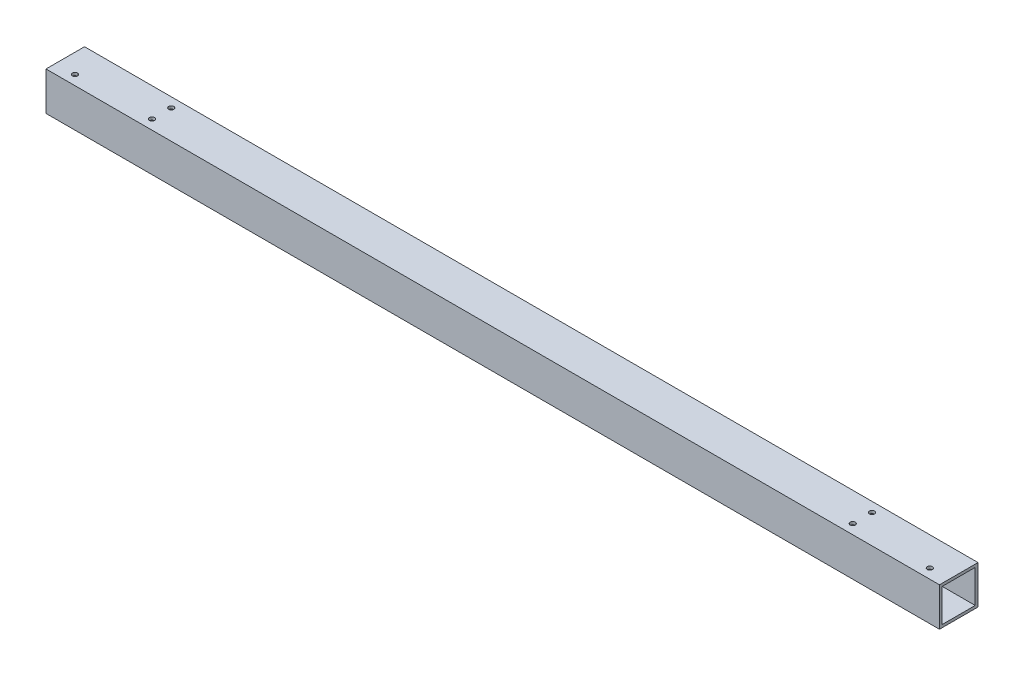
from build123d import *

# Parameters (mm, degrees)
SKETCH1_W          = 50.8
SKETCH1_H          = 50.8
SKETCH1_W_2        = 43.4848
SKETCH1_H_2        = 43.4848
EXTRUDE1_DEPTH     = 3048
SKETCH10_W         = 1961.990435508
SKETCH10_H         = 307.115176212
EXTRUDE2_DEPTH     = 3049.846549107
SKETCH11_R         = 3.37312
CUT_EXTRUDE8_DEPTH = 1180.987037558


with BuildPart() as part:
    # Sketch1 → Extrude1 (new body)
    with BuildSketch(Plane(origin=(0, 0, 0), x_dir=(0, 0, -1), z_dir=(1, 0, 0))):
        with Locations((25.4, 25.4)):
            Rectangle(SKETCH1_W, SKETCH1_H)
        with Locations((25.4, 25.4)):
            Rectangle(SKETCH1_W_2, SKETCH1_H_2, mode=Mode.SUBTRACT)
    extrude(amount=EXTRUDE1_DEPTH)

    # Sketch10 → Extrude2 (cut, through all)
    with BuildSketch(Plane.XY):
        with Locations((2158.793217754, 12.917035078)):
            Rectangle(SKETCH10_W, SKETCH10_H)
    extrude(amount=-EXTRUDE2_DEPTH, mode=Mode.SUBTRACT)

    # Sketch11 → Cut-Extrude8 (cut, through all)
    with BuildSketch(Plane.XZ):
        with Locations(Location((1050.798, -12.7, 0), (0, 0, 270))):
            Circle(SKETCH11_R)
        with Locations(Location((1050.798, -38.1, 0), (0, 0, 270))):
            Circle(SKETCH11_R)
        with Locations(Location((1152.398, -12.7, 0), (0, 0, 270))):
            Circle(SKETCH11_R)
        with Locations(Location((25.4, -12.7, 0), (0, 0, 270))):
            Circle(SKETCH11_R)
        with Locations(Location((127, -38.1, 0), (0, 0, 270))):
            Circle(SKETCH11_R)
        with Locations(Location((127, -12.7, 0), (0, 0, 270))):
            Circle(SKETCH11_R)
    extrude(amount=-CUT_EXTRUDE8_DEPTH, mode=Mode.SUBTRACT)


solid = part.part
